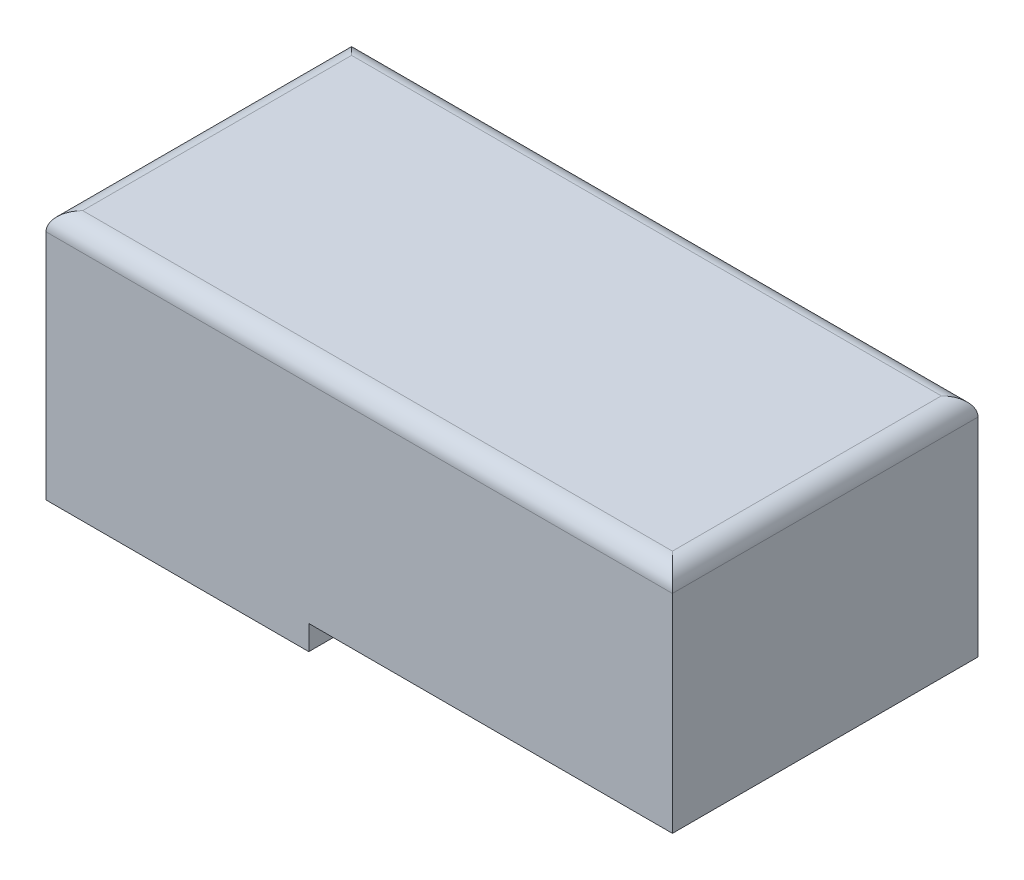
from build123d import *

# Parameters (mm, degrees)
EXTRUDE_1_DEPTH     = 25
SKETCH_2_R          = 7.5
CUT_EXTRUDE_1_DEPTH = 97.120259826
SKETCH_5_R          = 7.5
CUT_EXTRUDE_2_DEPTH = 97.120259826
SKETCH_10_W         = 3
SKETCH_10_H         = 50
CUT_EXTRUDE_4_DEPTH = 97.120259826
SKETCH_11_W         = 102.5
SKETCH_11_H         = 50
EXTRUDE_2_DEPTH     = 29
FILLET_1_R          = 3


with BuildPart() as part:
    # Sketch 1 → Extrude 1 (new, symmetric)
    with BuildSketch(Plane.XY):
        Polygon((-92.033169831, -4), (-92.033169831, 8), (13.466830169, 8), (13.466830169, 0), (-49.033169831, 0), (-49.033169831, -4), align=None)
    extrude(amount=EXTRUDE_1_DEPTH, both=True)

    # Sketch 2 → Cut-Extrude 1 (cut, through all)
    with BuildSketch(Plane(origin=(0, 8, 0), x_dir=(1, 0, 0), z_dir=(0, 1, 0))):
        with Locations(Location((-71.033169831, 0, 0), (0, 0, 270))):
            Circle(SKETCH_2_R)
    extrude(amount=-CUT_EXTRUDE_1_DEPTH, mode=Mode.SUBTRACT)

    # Sketch 5 → Cut-Extrude 2 (cut, through all)
    with BuildSketch(Plane(origin=(0, 8, 0), x_dir=(1, 0, 0), z_dir=(0, 1, 0))):
        with Locations(Location((-71.033169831, 0, 0), (0, 0, 270))):
            Circle(SKETCH_5_R)
        with BuildLine():
            Line((-17.533169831, 5), (-7.533169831, 5))
            ThreePointArc((-7.533169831, 5), (-2.533169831, 0), (-7.533169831, -5))
            Line((-7.533169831, -5), (-17.533169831, -5))
            ThreePointArc((-17.533169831, -5), (-22.533169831, 0), (-17.533169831, 5))
        make_face()
    extrude(amount=-CUT_EXTRUDE_2_DEPTH, mode=Mode.SUBTRACT)

    # Sketch 10 → Cut-Extrude 4 (cut, through all)
    with BuildSketch(Plane(origin=(0, 8, 0), x_dir=(1, 0, 0), z_dir=(0, 1, 0))):
        with Locations((11.966830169, 0)):
            Rectangle(SKETCH_10_W, SKETCH_10_H)
    extrude(amount=-CUT_EXTRUDE_4_DEPTH, mode=Mode.SUBTRACT)

    # Sketch 11 → Extrude 2 (add)
    with BuildSketch(Plane(origin=(0, 8, 0), x_dir=(1, 0, 0), z_dir=(0, 1, 0))):
        with Locations((-40.783169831, 0)):
            Rectangle(SKETCH_11_W, SKETCH_11_H)
    extrude(amount=EXTRUDE_2_DEPTH)

    # Fillet 1
    fillet_1_edges = [part.edges().sort_by_distance(p)[0] for p in [
        (-92.033169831, 37, 0),
        (-40.783169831, 37, 25),
        (10.466830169, 37, 0),
        (-40.783169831, 37, -25),
    ]]
    fillet(fillet_1_edges, radius=FILLET_1_R)


solid = part.part
